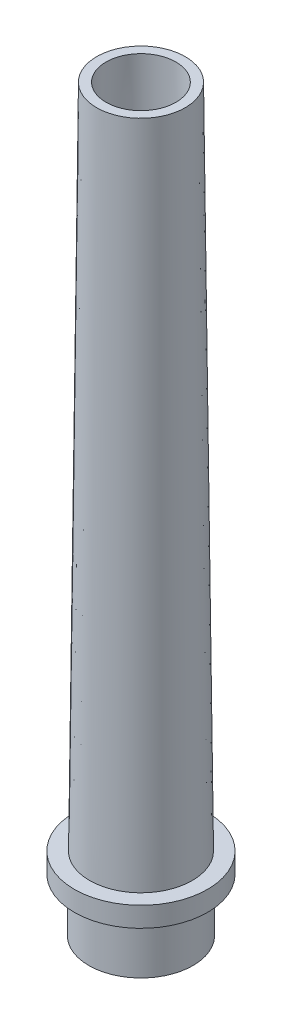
ISO-10303-21;
HEADER;
FILE_DESCRIPTION(('STEP AP214'),'2;1');
FILE_NAME('part.step','',(''),(''),'','','');
FILE_SCHEMA(('AUTOMOTIVE_DESIGN { 1 0 10303 214 1 1 1 1 }'));
ENDSEC;
DATA;
#1=APPLICATION_CONTEXT('core data for automotive mechanical design processes');
#2=APPLICATION_PROTOCOL_DEFINITION('international standard','automotive_design',2000,#1);
#3=PRODUCT_CONTEXT('',#1,'mechanical');
#4=PRODUCT('Part','Part','',(#3));
#5=PRODUCT_RELATED_PRODUCT_CATEGORY('part','',(#4));
#6=PRODUCT_DEFINITION_FORMATION('','',#4);
#7=PRODUCT_DEFINITION_CONTEXT('part definition',#1,'design');
#8=PRODUCT_DEFINITION('design','',#6,#7);
#9=PRODUCT_DEFINITION_SHAPE('','',#8);
#10=(LENGTH_UNIT() NAMED_UNIT(*) SI_UNIT(.MILLI.,.METRE.));
#11=(NAMED_UNIT(*) PLANE_ANGLE_UNIT() SI_UNIT($,.RADIAN.));
#12=(NAMED_UNIT(*) SI_UNIT($,.STERADIAN.) SOLID_ANGLE_UNIT());
#13=UNCERTAINTY_MEASURE_WITH_UNIT(LENGTH_MEASURE(1.E-05),#10,'distance_accuracy_value','');
#14=(GEOMETRIC_REPRESENTATION_CONTEXT(3) GLOBAL_UNCERTAINTY_ASSIGNED_CONTEXT((#13)) GLOBAL_UNIT_ASSIGNED_CONTEXT((#10,
#11,#12)) REPRESENTATION_CONTEXT('',''));
#15=CARTESIAN_POINT('',(0.,0.,0.));
#16=DIRECTION('',(0.,0.,1.));
#17=DIRECTION('',(1.,0.,0.));
#18=AXIS2_PLACEMENT_3D('',#15,#16,#17);
#19=CARTESIAN_POINT('',(0.,0.,0.));
#20=DIRECTION('',(0.,-1.,0.));
#21=DIRECTION('',(0.,0.,-1.));
#22=AXIS2_PLACEMENT_3D('',#19,#20,#21);
#23=CONICAL_SURFACE('',#22,7.825,0.0105851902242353);
#24=CARTESIAN_POINT('',(0.,11.,0.));
#25=DIRECTION('',(0.,1.,0.));
#26=DIRECTION('',(0.,0.,1.));
#27=AXIS2_PLACEMENT_3D('',#24,#25,#26);
#28=CIRCLE('',#27,7.70855855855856);
#29=CARTESIAN_POINT('',(0.,11.,7.70855855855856));
#30=VERTEX_POINT('',#29);
#31=EDGE_CURVE('E37',#30,#30,#28,.T.);
#32=ORIENTED_EDGE('',*,*,#31,.T.);
#33=EDGE_LOOP('',(#32));
#34=FACE_BOUND('',#33,.T.);
#35=CARTESIAN_POINT('',(0.,111.,0.));
#36=DIRECTION('',(0.,1.,0.));
#37=DIRECTION('',(0.,0.,1.));
#38=AXIS2_PLACEMENT_3D('',#35,#36,#37);
#39=CIRCLE('',#38,6.65);
#40=CARTESIAN_POINT('',(0.,111.,6.65));
#41=VERTEX_POINT('',#40);
#42=EDGE_CURVE('E45',#41,#41,#39,.T.);
#43=ORIENTED_EDGE('',*,*,#42,.F.);
#44=EDGE_LOOP('',(#43));
#45=FACE_BOUND('',#44,.T.);
#46=ADVANCED_FACE('F33',(#34,#45),#23,.T.);
#47=CARTESIAN_POINT('',(6.125,0.,0.));
#48=DIRECTION('',(0.,1.,0.));
#49=DIRECTION('',(0.,0.,1.));
#50=AXIS2_PLACEMENT_3D('',#47,#48,#49);
#51=PLANE('',#50);
#52=CARTESIAN_POINT('',(0.,0.,0.));
#53=DIRECTION('',(0.,1.,0.));
#54=DIRECTION('',(0.,0.,1.));
#55=AXIS2_PLACEMENT_3D('',#52,#53,#54);
#56=CIRCLE('',#55,7.825);
#57=CARTESIAN_POINT('',(0.,0.,7.825));
#58=VERTEX_POINT('',#57);
#59=EDGE_CURVE('E50',#58,#58,#56,.T.);
#60=ORIENTED_EDGE('',*,*,#59,.F.);
#61=EDGE_LOOP('',(#60));
#62=FACE_BOUND('',#61,.T.);
#63=CARTESIAN_POINT('',(0.,0.,0.));
#64=DIRECTION('',(0.,1.,0.));
#65=DIRECTION('',(0.,0.,1.));
#66=AXIS2_PLACEMENT_3D('',#63,#64,#65);
#67=CIRCLE('',#66,6.125);
#68=CARTESIAN_POINT('',(0.,0.,6.125));
#69=VERTEX_POINT('',#68);
#70=EDGE_CURVE('E10',#69,#69,#67,.T.);
#71=ORIENTED_EDGE('',*,*,#70,.T.);
#72=EDGE_LOOP('',(#71));
#73=FACE_BOUND('',#72,.T.);
#74=ADVANCED_FACE('F35',(#62,#73),#51,.F.);
#75=CARTESIAN_POINT('',(0.,111.,0.));
#76=DIRECTION('',(0.,-1.,0.));
#77=DIRECTION('',(0.,0.,-1.));
#78=AXIS2_PLACEMENT_3D('',#75,#76,#77);
#79=CONICAL_SURFACE('',#78,5.25,0.00788271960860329);
#80=ORIENTED_EDGE('',*,*,#70,.F.);
#81=EDGE_LOOP('',(#80));
#82=FACE_BOUND('',#81,.T.);
#83=CARTESIAN_POINT('',(0.,111.,0.));
#84=DIRECTION('',(0.,1.,0.));
#85=DIRECTION('',(0.,0.,1.));
#86=AXIS2_PLACEMENT_3D('',#83,#84,#85);
#87=CIRCLE('',#86,5.25);
#88=CARTESIAN_POINT('',(0.,111.,5.25));
#89=VERTEX_POINT('',#88);
#90=EDGE_CURVE('E41',#89,#89,#87,.T.);
#91=ORIENTED_EDGE('',*,*,#90,.T.);
#92=EDGE_LOOP('',(#91));
#93=FACE_BOUND('',#92,.T.);
#94=ADVANCED_FACE('F88',(#82,#93),#79,.F.);
#95=CARTESIAN_POINT('',(6.65,111.,0.));
#96=DIRECTION('',(0.,-1.,0.));
#97=DIRECTION('',(0.,0.,-1.));
#98=AXIS2_PLACEMENT_3D('',#95,#96,#97);
#99=PLANE('',#98);
#100=ORIENTED_EDGE('',*,*,#90,.F.);
#101=EDGE_LOOP('',(#100));
#102=FACE_BOUND('',#101,.T.);
#103=ORIENTED_EDGE('',*,*,#42,.T.);
#104=EDGE_LOOP('',(#103));
#105=FACE_BOUND('',#104,.T.);
#106=ADVANCED_FACE('F94',(#102,#105),#99,.F.);
#107=CARTESIAN_POINT('',(0.,8.,0.));
#108=DIRECTION('',(0.,-1.,0.));
#109=DIRECTION('',(0.,0.,-1.));
#110=AXIS2_PLACEMENT_3D('',#107,#108,#109);
#111=CYLINDRICAL_SURFACE('',#110,7.825);
#112=CARTESIAN_POINT('',(0.,8.,0.));
#113=DIRECTION('',(0.,1.,0.));
#114=DIRECTION('',(0.,0.,1.));
#115=AXIS2_PLACEMENT_3D('',#112,#113,#114);
#116=CIRCLE('',#115,7.825);
#117=CARTESIAN_POINT('',(0.,8.,7.825));
#118=VERTEX_POINT('',#117);
#119=EDGE_CURVE('E53',#118,#118,#116,.F.);
#120=ORIENTED_EDGE('',*,*,#119,.T.);
#121=EDGE_LOOP('',(#120));
#122=FACE_BOUND('',#121,.T.);
#123=ORIENTED_EDGE('',*,*,#59,.T.);
#124=EDGE_LOOP('',(#123));
#125=FACE_BOUND('',#124,.T.);
#126=ADVANCED_FACE('F78',(#122,#125),#111,.T.);
#127=CARTESIAN_POINT('',(0.,11.,0.));
#128=DIRECTION('',(0.,1.,0.));
#129=DIRECTION('',(0.,0.,1.));
#130=AXIS2_PLACEMENT_3D('',#127,#128,#129);
#131=PLANE('',#130);
#132=ORIENTED_EDGE('',*,*,#31,.F.);
#133=EDGE_LOOP('',(#132));
#134=FACE_BOUND('',#133,.T.);
#135=CARTESIAN_POINT('',(0.,11.,0.));
#136=DIRECTION('',(0.,1.,0.));
#137=DIRECTION('',(0.,0.,1.));
#138=AXIS2_PLACEMENT_3D('',#135,#136,#137);
#139=CIRCLE('',#138,10.);
#140=CARTESIAN_POINT('',(0.,11.,10.));
#141=VERTEX_POINT('',#140);
#142=EDGE_CURVE('E56',#141,#141,#139,.T.);
#143=ORIENTED_EDGE('',*,*,#142,.T.);
#144=EDGE_LOOP('',(#143));
#145=FACE_BOUND('',#144,.T.);
#146=ADVANCED_FACE('F63',(#134,#145),#131,.T.);
#147=CARTESIAN_POINT('',(0.,8.,0.));
#148=DIRECTION('',(0.,1.,0.));
#149=DIRECTION('',(0.,0.,1.));
#150=AXIS2_PLACEMENT_3D('',#147,#148,#149);
#151=PLANE('',#150);
#152=ORIENTED_EDGE('',*,*,#119,.F.);
#153=EDGE_LOOP('',(#152));
#154=FACE_BOUND('',#153,.T.);
#155=CARTESIAN_POINT('',(0.,8.,0.));
#156=DIRECTION('',(0.,1.,0.));
#157=DIRECTION('',(0.,0.,1.));
#158=AXIS2_PLACEMENT_3D('',#155,#156,#157);
#159=CIRCLE('',#158,10.);
#160=CARTESIAN_POINT('',(0.,8.,10.));
#161=VERTEX_POINT('',#160);
#162=EDGE_CURVE('E57',#161,#161,#159,.T.);
#163=ORIENTED_EDGE('',*,*,#162,.F.);
#164=EDGE_LOOP('',(#163));
#165=FACE_BOUND('',#164,.T.);
#166=ADVANCED_FACE('F68',(#154,#165),#151,.F.);
#167=CARTESIAN_POINT('',(0.,11.,0.));
#168=DIRECTION('',(0.,-1.,0.));
#169=DIRECTION('',(0.,0.,-1.));
#170=AXIS2_PLACEMENT_3D('',#167,#168,#169);
#171=CYLINDRICAL_SURFACE('',#170,10.);
#172=ORIENTED_EDGE('',*,*,#142,.F.);
#173=EDGE_LOOP('',(#172));
#174=FACE_BOUND('',#173,.T.);
#175=ORIENTED_EDGE('',*,*,#162,.T.);
#176=EDGE_LOOP('',(#175));
#177=FACE_BOUND('',#176,.T.);
#178=ADVANCED_FACE('F65',(#174,#177),#171,.T.);
#179=CLOSED_SHELL('',(#46,#74,#94,#106,#126,#146,#166,#178));
#180=MANIFOLD_SOLID_BREP('B2',#179);
#181=ADVANCED_BREP_SHAPE_REPRESENTATION('',(#18,#180),#14);
#182=SHAPE_DEFINITION_REPRESENTATION(#9,#181);
ENDSEC;
END-ISO-10303-21;
